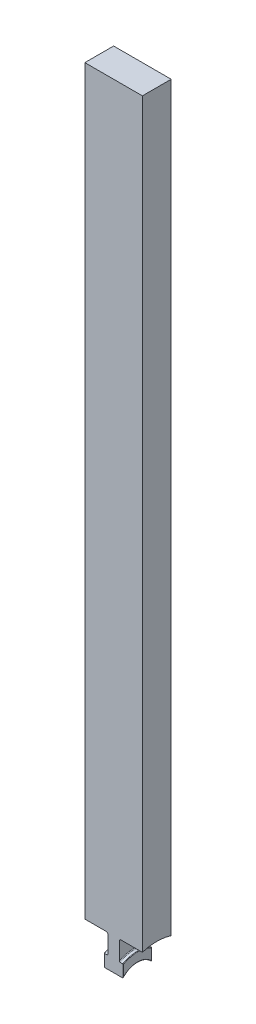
ISO-10303-21;
HEADER;
FILE_DESCRIPTION(('STEP AP214'),'2;1');
FILE_NAME('part.step','',(''),(''),'','','');
FILE_SCHEMA(('AUTOMOTIVE_DESIGN { 1 0 10303 214 1 1 1 1 }'));
ENDSEC;
DATA;
#1=APPLICATION_CONTEXT('core data for automotive mechanical design processes');
#2=APPLICATION_PROTOCOL_DEFINITION('international standard','automotive_design',2000,#1);
#3=PRODUCT_CONTEXT('',#1,'mechanical');
#4=PRODUCT('Part','Part','',(#3));
#5=PRODUCT_RELATED_PRODUCT_CATEGORY('part','',(#4));
#6=PRODUCT_DEFINITION_FORMATION('','',#4);
#7=PRODUCT_DEFINITION_CONTEXT('part definition',#1,'design');
#8=PRODUCT_DEFINITION('design','',#6,#7);
#9=PRODUCT_DEFINITION_SHAPE('','',#8);
#10=(LENGTH_UNIT() NAMED_UNIT(*) SI_UNIT(.MILLI.,.METRE.));
#11=(NAMED_UNIT(*) PLANE_ANGLE_UNIT() SI_UNIT($,.RADIAN.));
#12=(NAMED_UNIT(*) SI_UNIT($,.STERADIAN.) SOLID_ANGLE_UNIT());
#13=UNCERTAINTY_MEASURE_WITH_UNIT(LENGTH_MEASURE(1.E-05),#10,'distance_accuracy_value','');
#14=(GEOMETRIC_REPRESENTATION_CONTEXT(3) GLOBAL_UNCERTAINTY_ASSIGNED_CONTEXT((#13)) GLOBAL_UNIT_ASSIGNED_CONTEXT((#10,
#11,#12)) REPRESENTATION_CONTEXT('',''));
#15=CARTESIAN_POINT('',(0.,0.,0.));
#16=DIRECTION('',(0.,0.,1.));
#17=DIRECTION('',(1.,0.,0.));
#18=AXIS2_PLACEMENT_3D('',#15,#16,#17);
#19=CARTESIAN_POINT('',(15.,410.,7.50000000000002));
#20=DIRECTION('',(0.,0.,-1.));
#21=DIRECTION('',(0.,1.,0.));
#22=AXIS2_PLACEMENT_3D('',#19,#20,#21);
#23=PLANE('',#22);
#24=DIRECTION('',(-1.,0.,0.));
#25=VECTOR('',#24,1.);
#26=CARTESIAN_POINT('',(-8.84822894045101,12.9903810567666,7.49999999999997));
#27=LINE('',#26,#25);
#28=CARTESIAN_POINT('',(-4.75,12.9903810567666,7.49999999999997));
#29=VERTEX_POINT('',#28);
#30=CARTESIAN_POINT('',(-3.381,12.9903810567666,7.49999999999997));
#31=VERTEX_POINT('',#30);
#32=EDGE_CURVE('E731',#29,#31,#27,.F.);
#33=ORIENTED_EDGE('',*,*,#32,.F.);
#34=DIRECTION('',(0.,1.,0.));
#35=VECTOR('',#34,1.);
#36=CARTESIAN_POINT('',(-4.75000000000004,410.,7.50000000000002));
#37=LINE('',#36,#35);
#38=CARTESIAN_POINT('',(-4.75,6.61437827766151,7.49999999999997));
#39=VERTEX_POINT('',#38);
#40=EDGE_CURVE('E442',#29,#39,#37,.F.);
#41=ORIENTED_EDGE('',*,*,#40,.T.);
#42=DIRECTION('',(1.,0.,0.));
#43=VECTOR('',#42,1.);
#44=CARTESIAN_POINT('',(-15.,6.61437827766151,7.49999999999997));
#45=LINE('',#44,#43);
#46=CARTESIAN_POINT('',(4.75,6.61437827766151,7.49999999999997));
#47=VERTEX_POINT('',#46);
#48=EDGE_CURVE('E212',#39,#47,#45,.T.);
#49=ORIENTED_EDGE('',*,*,#48,.T.);
#50=DIRECTION('',(0.,-1.,0.));
#51=VECTOR('',#50,1.);
#52=CARTESIAN_POINT('',(4.74999999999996,410.,7.50000000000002));
#53=LINE('',#52,#51);
#54=CARTESIAN_POINT('',(4.75,12.9903810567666,7.49999999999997));
#55=VERTEX_POINT('',#54);
#56=EDGE_CURVE('E440',#47,#55,#53,.F.);
#57=ORIENTED_EDGE('',*,*,#56,.T.);
#58=DIRECTION('',(-1.,0.,0.));
#59=VECTOR('',#58,1.);
#60=CARTESIAN_POINT('',(-8.84822894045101,12.9903810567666,7.49999999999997));
#61=LINE('',#60,#59);
#62=CARTESIAN_POINT('',(3.381,12.9903810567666,7.49999999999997));
#63=VERTEX_POINT('',#62);
#64=EDGE_CURVE('E734',#63,#55,#61,.F.);
#65=ORIENTED_EDGE('',*,*,#64,.F.);
#66=CARTESIAN_POINT('',(3.381,12.9903810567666,7.49999999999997));
#67=CARTESIAN_POINT('',(3.36159348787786,12.990351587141,7.49999999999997));
#68=CARTESIAN_POINT('',(3.34220939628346,12.9920910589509,7.49999999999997));
#69=CARTESIAN_POINT('',(3.30411089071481,12.9988686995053,7.49999999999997));
#70=CARTESIAN_POINT('',(3.28539391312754,13.0038923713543,7.49999999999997));
#71=CARTESIAN_POINT('',(3.24909102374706,13.0169971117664,7.49999999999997));
#72=CARTESIAN_POINT('',(3.23150411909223,13.0250754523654,7.49999999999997));
#73=CARTESIAN_POINT('',(3.19783116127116,13.0439266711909,7.49999999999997));
#74=CARTESIAN_POINT('',(3.18174642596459,13.054701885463,7.49999999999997));
#75=CARTESIAN_POINT('',(3.15058262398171,13.0791681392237,7.49999999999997));
#76=CARTESIAN_POINT('',(3.1356009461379,13.0929827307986,7.49999999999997));
#77=CARTESIAN_POINT('',(3.10785285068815,13.1226713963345,7.49999999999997));
#78=CARTESIAN_POINT('',(3.09508691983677,13.1385459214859,7.49999999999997));
#79=CARTESIAN_POINT('',(3.07041818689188,13.1740413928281,7.49999999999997));
#80=CARTESIAN_POINT('',(3.05883169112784,13.1938820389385,7.49999999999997));
#81=CARTESIAN_POINT('',(3.03871875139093,13.235070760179,7.49999999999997));
#82=CARTESIAN_POINT('',(3.03019562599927,13.2564204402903,7.49999999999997));
#83=CARTESIAN_POINT('',(3.01549657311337,13.3025258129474,7.49999999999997));
#84=CARTESIAN_POINT('',(3.00968374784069,13.3273972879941,7.49999999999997));
#85=CARTESIAN_POINT('',(3.00193752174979,13.3776913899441,7.49999999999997));
#86=CARTESIAN_POINT('',(2.99999691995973,13.4031129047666,7.49999999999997));
#87=CARTESIAN_POINT('',(3.,13.428520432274,7.49999999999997));
#88=B_SPLINE_CURVE_WITH_KNOTS('',3,(#66,#67,#68,#69,#70,#71,#72,#73,#74,#75,#76,#77,#78,#79,#80,
#81,#82,#83,#84,#85,#86,#87),.UNSPECIFIED.,.F.,.F.,(4,2,2,2,2,2,2,2,2,2,4),(0.,
0.0581065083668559,0.115958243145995,0.173758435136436,0.231608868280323,0.292501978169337,
0.353408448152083,0.422061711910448,0.490789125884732,0.567105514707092,0.643279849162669),.UNSPECIFIED.);
#89=CARTESIAN_POINT('',(3.,13.428520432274,7.49999999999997));
#90=VERTEX_POINT('',#89);
#91=EDGE_CURVE('E312',#63,#90,#88,.T.);
#92=ORIENTED_EDGE('',*,*,#91,.T.);
#93=DIRECTION('',(0.,-1.,0.));
#94=VECTOR('',#93,1.);
#95=CARTESIAN_POINT('',(3.,410.,7.50000000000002));
#96=LINE('',#95,#94);
#97=CARTESIAN_POINT('',(3.,22.5220479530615,7.49999999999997));
#98=VERTEX_POINT('',#97);
#99=EDGE_CURVE('E464',#98,#90,#96,.T.);
#100=ORIENTED_EDGE('',*,*,#99,.F.);
#101=CARTESIAN_POINT('',(3.,22.5220479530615,7.49999999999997));
#102=CARTESIAN_POINT('',(2.99997149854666,22.5689651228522,7.49999999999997));
#103=CARTESIAN_POINT('',(3.00389939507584,22.6158879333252,7.49999999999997));
#104=CARTESIAN_POINT('',(3.01949238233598,22.7084725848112,7.49999999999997));
#105=CARTESIAN_POINT('',(3.03116447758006,22.754133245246,7.49999999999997));
#106=CARTESIAN_POINT('',(3.06208646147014,22.8428798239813,7.49999999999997));
#107=CARTESIAN_POINT('',(3.08134457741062,22.885962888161,7.49999999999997));
#108=CARTESIAN_POINT('',(3.12700930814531,22.9681343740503,7.49999999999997));
#109=CARTESIAN_POINT('',(3.15341113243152,23.0072254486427,7.49999999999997));
#110=CARTESIAN_POINT('',(3.21190757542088,23.0791064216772,7.49999999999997));
#111=CARTESIAN_POINT('',(3.24382440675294,23.1120407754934,7.49999999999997));
#112=CARTESIAN_POINT('',(3.31300016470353,23.171752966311,7.49999999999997));
#113=CARTESIAN_POINT('',(3.35025938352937,23.1985304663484,7.49999999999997));
#114=CARTESIAN_POINT('',(3.42707441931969,23.2437458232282,7.49999999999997));
#115=CARTESIAN_POINT('',(3.46642748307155,23.262528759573,7.49999999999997));
#116=CARTESIAN_POINT('',(3.54780361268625,23.2928652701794,7.49999999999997));
#117=CARTESIAN_POINT('',(3.58982304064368,23.3044284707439,7.49999999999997));
#118=CARTESIAN_POINT('',(3.65386676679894,23.3160362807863,7.49999999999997));
#119=CARTESIAN_POINT('',(3.67540624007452,23.3189494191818,7.49999999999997));
#120=CARTESIAN_POINT('',(3.71862671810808,23.322833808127,7.49999999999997));
#121=CARTESIAN_POINT('',(3.74030745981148,23.323807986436,7.49999999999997));
#122=CARTESIAN_POINT('',(3.76199999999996,23.3238075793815,7.49999999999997));
#123=B_SPLINE_CURVE_WITH_KNOTS('',3,(#101,#102,#103,#104,#105,#106,#107,#108,#109,#110,#111,
#112,#113,#114,#115,#116,#117,#118,#119,#120,#121,#122),.UNSPECIFIED.,.F.,.F.,(4,2,2,2,2,2,2,2,
2,2,4),(0.,0.140598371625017,0.281324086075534,0.422202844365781,0.562987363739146,
0.699875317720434,0.836770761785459,0.966940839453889,1.09693698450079,1.16206792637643,
1.22710044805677),.UNSPECIFIED.);
#124=CARTESIAN_POINT('',(3.762,23.3238075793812,7.49999999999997));
#125=VERTEX_POINT('',#124);
#126=EDGE_CURVE('E277',#98,#125,#123,.T.);
#127=ORIENTED_EDGE('',*,*,#126,.T.);
#128=DIRECTION('',(-1.,0.,0.));
#129=VECTOR('',#128,1.);
#130=CARTESIAN_POINT('',(-8.84822894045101,23.3238075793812,7.49999999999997));
#131=LINE('',#130,#129);
#132=CARTESIAN_POINT('',(15.,23.3238075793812,7.49999999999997));
#133=VERTEX_POINT('',#132);
#134=EDGE_CURVE('E741',#133,#125,#131,.T.);
#135=ORIENTED_EDGE('',*,*,#134,.F.);
#136=DIRECTION('',(0.,-1.,0.));
#137=VECTOR('',#136,1.);
#138=CARTESIAN_POINT('',(15.,410.,7.50000000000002));
#139=LINE('',#138,#137);
#140=CARTESIAN_POINT('',(15.,410.,7.50000000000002));
#141=VERTEX_POINT('',#140);
#142=EDGE_CURVE('E470',#141,#133,#139,.T.);
#143=ORIENTED_EDGE('',*,*,#142,.F.);
#144=DIRECTION('',(-1.,0.,0.));
#145=VECTOR('',#144,1.);
#146=CARTESIAN_POINT('',(15.,410.,7.50000000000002));
#147=LINE('',#146,#145);
#148=CARTESIAN_POINT('',(-15.,410.,7.50000000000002));
#149=VERTEX_POINT('',#148);
#150=EDGE_CURVE('E206',#141,#149,#147,.T.);
#151=ORIENTED_EDGE('',*,*,#150,.T.);
#152=DIRECTION('',(0.,-1.,0.));
#153=VECTOR('',#152,1.);
#154=CARTESIAN_POINT('',(-15.,410.,7.50000000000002));
#155=LINE('',#154,#153);
#156=CARTESIAN_POINT('',(-15.,23.3238075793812,7.49999999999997));
#157=VERTEX_POINT('',#156);
#158=EDGE_CURVE('E198',#149,#157,#155,.T.);
#159=ORIENTED_EDGE('',*,*,#158,.T.);
#160=DIRECTION('',(-1.,0.,0.));
#161=VECTOR('',#160,1.);
#162=CARTESIAN_POINT('',(-8.84822894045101,23.3238075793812,7.49999999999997));
#163=LINE('',#162,#161);
#164=CARTESIAN_POINT('',(-3.762,23.3238075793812,7.49999999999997));
#165=VERTEX_POINT('',#164);
#166=EDGE_CURVE('E179',#165,#157,#163,.T.);
#167=ORIENTED_EDGE('',*,*,#166,.F.);
#168=CARTESIAN_POINT('',(-3.762,23.3238075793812,7.49999999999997));
#169=CARTESIAN_POINT('',(-3.72062832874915,23.3238520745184,7.49999999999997));
#170=CARTESIAN_POINT('',(-3.67927922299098,23.3202713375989,7.49999999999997));
#171=CARTESIAN_POINT('',(-3.59785901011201,23.3062018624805,7.49999999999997));
#172=CARTESIAN_POINT('',(-3.55778541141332,23.2957275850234,7.49999999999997));
#173=CARTESIAN_POINT('',(-3.47996559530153,23.2682105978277,7.49999999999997));
#174=CARTESIAN_POINT('',(-3.44221943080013,23.2511677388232,7.49999999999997));
#175=CARTESIAN_POINT('',(-3.37004313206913,23.2111093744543,7.49999999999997));
#176=CARTESIAN_POINT('',(-3.33561363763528,23.1880927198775,7.49999999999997));
#177=CARTESIAN_POINT('',(-3.27027005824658,23.1363093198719,7.49999999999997));
#178=CARTESIAN_POINT('',(-3.23943952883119,23.107437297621,7.49999999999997));
#179=CARTESIAN_POINT('',(-3.18280382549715,23.0451270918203,7.49999999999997));
#180=CARTESIAN_POINT('',(-3.15699985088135,23.0116878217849,7.49999999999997));
#181=CARTESIAN_POINT('',(-3.10989501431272,22.9395756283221,7.49999999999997));
#182=CARTESIAN_POINT('',(-3.08885347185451,22.9007334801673,7.49999999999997));
#183=CARTESIAN_POINT('',(-3.05325919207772,22.8201786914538,7.49999999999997));
#184=CARTESIAN_POINT('',(-3.03870727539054,22.7784656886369,7.49999999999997));
#185=CARTESIAN_POINT('',(-3.01837577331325,22.7009990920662,7.49999999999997));
#186=CARTESIAN_POINT('',(-3.01148586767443,22.6655314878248,7.49999999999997));
#187=CARTESIAN_POINT('',(-3.00229780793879,22.5940601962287,7.49999999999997));
#188=CARTESIAN_POINT('',(-2.99999277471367,22.5580573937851,7.49999999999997));
#189=CARTESIAN_POINT('',(-3.,22.5220479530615,7.49999999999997));
#190=B_SPLINE_CURVE_WITH_KNOTS('',3,(#168,#169,#170,#171,#172,#173,#174,#175,#176,#177,#178,
#179,#180,#181,#182,#183,#184,#185,#186,#187,#188,#189),.UNSPECIFIED.,.F.,.F.,(4,2,2,2,2,2,2,2,
2,2,4),(0.,0.12392580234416,0.247592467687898,0.371261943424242,0.49495522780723,
0.621109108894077,0.747293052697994,0.879236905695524,1.01119743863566,1.11930081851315,
1.2272418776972),.UNSPECIFIED.);
#191=CARTESIAN_POINT('',(-3.,22.5220479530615,7.49999999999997));
#192=VERTEX_POINT('',#191);
#193=EDGE_CURVE('E243',#165,#192,#190,.T.);
#194=ORIENTED_EDGE('',*,*,#193,.T.);
#195=DIRECTION('',(0.,1.,0.));
#196=VECTOR('',#195,1.);
#197=CARTESIAN_POINT('',(-3.,410.,7.50000000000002));
#198=LINE('',#197,#196);
#199=CARTESIAN_POINT('',(-3.,13.428520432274,7.49999999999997));
#200=VERTEX_POINT('',#199);
#201=EDGE_CURVE('E732',#200,#192,#198,.T.);
#202=ORIENTED_EDGE('',*,*,#201,.F.);
#203=CARTESIAN_POINT('',(-3.,13.428520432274,7.49999999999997));
#204=CARTESIAN_POINT('',(-2.99998773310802,13.3960473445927,7.49999999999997));
#205=CARTESIAN_POINT('',(-3.00316588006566,13.3635248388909,7.49999999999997));
#206=CARTESIAN_POINT('',(-3.01585357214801,13.2995632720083,7.49999999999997));
#207=CARTESIAN_POINT('',(-3.02539701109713,13.2681309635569,7.49999999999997));
#208=CARTESIAN_POINT('',(-3.04884901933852,13.2124568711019,7.49999999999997));
#209=CARTESIAN_POINT('',(-3.06188078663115,13.1878460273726,7.49999999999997));
#210=CARTESIAN_POINT('',(-3.09231245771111,13.1415402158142,7.49999999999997));
#211=CARTESIAN_POINT('',(-3.10970093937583,13.1198378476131,7.49999999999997));
#212=CARTESIAN_POINT('',(-3.14655915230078,13.0824144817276,7.49999999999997));
#213=CARTESIAN_POINT('',(-3.16563766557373,13.0663097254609,7.49999999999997));
#214=CARTESIAN_POINT('',(-3.20659393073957,13.0381967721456,7.49999999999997));
#215=CARTESIAN_POINT('',(-3.22846666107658,13.0261813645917,7.49999999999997));
#216=CARTESIAN_POINT('',(-3.2717749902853,13.0081040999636,7.49999999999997));
#217=CARTESIAN_POINT('',(-3.2929987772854,13.0015363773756,7.49999999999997));
#218=CARTESIAN_POINT('',(-3.33646159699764,12.9926369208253,7.49999999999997));
#219=CARTESIAN_POINT('',(-3.35870658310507,12.9903344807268,7.49999999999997));
#220=CARTESIAN_POINT('',(-3.381,12.9903810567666,7.49999999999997));
#221=B_SPLINE_CURVE_WITH_KNOTS('',3,(#203,#204,#205,#206,#207,#208,#209,#210,#211,#212,#213,
#214,#215,#216,#217,#218,#219,#220),.UNSPECIFIED.,.F.,.F.,(4,2,2,2,2,2,2,2,4),(0.,
0.0973546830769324,0.195231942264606,0.278328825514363,0.36121009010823,0.435666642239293,
0.509991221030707,0.576221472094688,0.642904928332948),.UNSPECIFIED.);
#222=EDGE_CURVE('E292',#200,#31,#221,.T.);
#223=ORIENTED_EDGE('',*,*,#222,.T.);
#224=EDGE_LOOP('',(#33,#41,#49,#57,#65,#92,#100,#127,#135,#143,#151,#159,#167,#194,#202,#223));
#225=FACE_BOUND('',#224,.T.);
#226=ADVANCED_FACE('F37',(#225),#23,.F.);
#227=CARTESIAN_POINT('',(15.,410.,-7.49999999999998));
#228=DIRECTION('',(0.,0.,1.));
#229=DIRECTION('',(0.,-1.,0.));
#230=AXIS2_PLACEMENT_3D('',#227,#228,#229);
#231=PLANE('',#230);
#232=DIRECTION('',(1.,0.,0.));
#233=VECTOR('',#232,1.);
#234=CARTESIAN_POINT('',(-15.,6.61437827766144,-7.50000000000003));
#235=LINE('',#234,#233);
#236=CARTESIAN_POINT('',(4.75,6.61437827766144,-7.50000000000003));
#237=VERTEX_POINT('',#236);
#238=CARTESIAN_POINT('',(-4.75,6.61437827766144,-7.50000000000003));
#239=VERTEX_POINT('',#238);
#240=EDGE_CURVE('E462',#237,#239,#235,.F.);
#241=ORIENTED_EDGE('',*,*,#240,.T.);
#242=DIRECTION('',(0.,1.,0.));
#243=VECTOR('',#242,1.);
#244=CARTESIAN_POINT('',(-4.75000000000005,410.,-7.49999999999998));
#245=LINE('',#244,#243);
#246=CARTESIAN_POINT('',(-4.75,12.9903810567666,-7.50000000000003));
#247=VERTEX_POINT('',#246);
#248=EDGE_CURVE('E432',#239,#247,#245,.T.);
#249=ORIENTED_EDGE('',*,*,#248,.T.);
#250=DIRECTION('',(-1.,0.,0.));
#251=VECTOR('',#250,1.);
#252=CARTESIAN_POINT('',(-8.84822894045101,12.9903810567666,-7.50000000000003));
#253=LINE('',#252,#251);
#254=CARTESIAN_POINT('',(-3.381,12.9903810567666,-7.50000000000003));
#255=VERTEX_POINT('',#254);
#256=EDGE_CURVE('E747',#255,#247,#253,.T.);
#257=ORIENTED_EDGE('',*,*,#256,.F.);
#258=CARTESIAN_POINT('',(-3.381,12.9903810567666,-7.50000000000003));
#259=CARTESIAN_POINT('',(-3.36159348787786,12.9903515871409,-7.50000000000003));
#260=CARTESIAN_POINT('',(-3.34220939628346,12.9920910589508,-7.50000000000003));
#261=CARTESIAN_POINT('',(-3.30411089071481,12.9988686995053,-7.50000000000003));
#262=CARTESIAN_POINT('',(-3.28539391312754,13.0038923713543,-7.50000000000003));
#263=CARTESIAN_POINT('',(-3.24909102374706,13.0169971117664,-7.50000000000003));
#264=CARTESIAN_POINT('',(-3.23150411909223,13.0250754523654,-7.50000000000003));
#265=CARTESIAN_POINT('',(-3.19783116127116,13.0439266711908,-7.50000000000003));
#266=CARTESIAN_POINT('',(-3.18174642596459,13.054701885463,-7.50000000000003));
#267=CARTESIAN_POINT('',(-3.1505826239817,13.0791681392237,-7.50000000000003));
#268=CARTESIAN_POINT('',(-3.13560094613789,13.0929827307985,-7.50000000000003));
#269=CARTESIAN_POINT('',(-3.10785285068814,13.1226713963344,-7.50000000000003));
#270=CARTESIAN_POINT('',(-3.09508691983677,13.1385459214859,-7.50000000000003));
#271=CARTESIAN_POINT('',(-3.07041818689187,13.174041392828,-7.50000000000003));
#272=CARTESIAN_POINT('',(-3.05883169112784,13.1938820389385,-7.50000000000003));
#273=CARTESIAN_POINT('',(-3.03871875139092,13.2350707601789,-7.50000000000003));
#274=CARTESIAN_POINT('',(-3.03019562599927,13.2564204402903,-7.50000000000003));
#275=CARTESIAN_POINT('',(-3.01549657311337,13.3025258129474,-7.50000000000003));
#276=CARTESIAN_POINT('',(-3.00968374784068,13.327397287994,-7.50000000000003));
#277=CARTESIAN_POINT('',(-3.00193752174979,13.3776913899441,-7.50000000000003));
#278=CARTESIAN_POINT('',(-2.99999691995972,13.4031129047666,-7.50000000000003));
#279=CARTESIAN_POINT('',(-3.,13.428520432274,-7.50000000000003));
#280=B_SPLINE_CURVE_WITH_KNOTS('',3,(#258,#259,#260,#261,#262,#263,#264,#265,#266,#267,#268,
#269,#270,#271,#272,#273,#274,#275,#276,#277,#278,#279),.UNSPECIFIED.,.F.,.F.,(4,2,2,2,2,2,2,2,
2,2,4),(0.,0.058106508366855,0.115958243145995,0.173758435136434,0.231608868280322,
0.292501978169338,0.353408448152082,0.422061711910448,0.490789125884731,0.567105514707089,
0.643279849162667),.UNSPECIFIED.);
#281=CARTESIAN_POINT('',(-3.,13.428520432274,-7.50000000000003));
#282=VERTEX_POINT('',#281);
#283=EDGE_CURVE('E301',#255,#282,#280,.T.);
#284=ORIENTED_EDGE('',*,*,#283,.T.);
#285=DIRECTION('',(0.,-1.,0.));
#286=VECTOR('',#285,1.);
#287=CARTESIAN_POINT('',(-3.,410.,-7.49999999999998));
#288=LINE('',#287,#286);
#289=CARTESIAN_POINT('',(-3.,22.5220479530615,-7.50000000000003));
#290=VERTEX_POINT('',#289);
#291=EDGE_CURVE('E221',#290,#282,#288,.T.);
#292=ORIENTED_EDGE('',*,*,#291,.F.);
#293=CARTESIAN_POINT('',(-3.,22.5220479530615,-7.50000000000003));
#294=CARTESIAN_POINT('',(-2.99997149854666,22.5689651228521,-7.50000000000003));
#295=CARTESIAN_POINT('',(-3.00389939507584,22.6158879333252,-7.50000000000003));
#296=CARTESIAN_POINT('',(-3.01949238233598,22.7084725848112,-7.50000000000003));
#297=CARTESIAN_POINT('',(-3.03116447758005,22.754133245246,-7.50000000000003));
#298=CARTESIAN_POINT('',(-3.06208646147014,22.8428798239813,-7.50000000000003));
#299=CARTESIAN_POINT('',(-3.08134457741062,22.8859628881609,-7.50000000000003));
#300=CARTESIAN_POINT('',(-3.12700930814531,22.9681343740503,-7.50000000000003));
#301=CARTESIAN_POINT('',(-3.15341113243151,23.0072254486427,-7.50000000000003));
#302=CARTESIAN_POINT('',(-3.21190757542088,23.0791064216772,-7.50000000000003));
#303=CARTESIAN_POINT('',(-3.24382440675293,23.1120407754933,-7.50000000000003));
#304=CARTESIAN_POINT('',(-3.31300016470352,23.1717529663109,-7.50000000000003));
#305=CARTESIAN_POINT('',(-3.35025938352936,23.1985304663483,-7.50000000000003));
#306=CARTESIAN_POINT('',(-3.42707441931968,23.2437458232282,-7.50000000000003));
#307=CARTESIAN_POINT('',(-3.46642748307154,23.262528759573,-7.50000000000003));
#308=CARTESIAN_POINT('',(-3.54780361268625,23.2928652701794,-7.50000000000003));
#309=CARTESIAN_POINT('',(-3.58982304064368,23.3044284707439,-7.50000000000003));
#310=CARTESIAN_POINT('',(-3.65386676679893,23.3160362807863,-7.50000000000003));
#311=CARTESIAN_POINT('',(-3.67540624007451,23.3189494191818,-7.50000000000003));
#312=CARTESIAN_POINT('',(-3.71862671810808,23.322833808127,-7.50000000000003));
#313=CARTESIAN_POINT('',(-3.74030745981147,23.323807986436,-7.50000000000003));
#314=CARTESIAN_POINT('',(-3.76199999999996,23.3238075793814,-7.50000000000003));
#315=B_SPLINE_CURVE_WITH_KNOTS('',3,(#293,#294,#295,#296,#297,#298,#299,#300,#301,#302,#303,
#304,#305,#306,#307,#308,#309,#310,#311,#312,#313,#314),.UNSPECIFIED.,.F.,.F.,(4,2,2,2,2,2,2,2,
2,2,4),(0.,0.140598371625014,0.281324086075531,0.422202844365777,0.562987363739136,
0.699875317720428,0.836770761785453,0.966940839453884,1.09693698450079,1.16206792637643,
1.22710044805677),.UNSPECIFIED.);
#316=CARTESIAN_POINT('',(-3.762,23.3238075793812,-7.50000000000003));
#317=VERTEX_POINT('',#316);
#318=EDGE_CURVE('E235',#290,#317,#315,.T.);
#319=ORIENTED_EDGE('',*,*,#318,.T.);
#320=DIRECTION('',(-1.,0.,0.));
#321=VECTOR('',#320,1.);
#322=CARTESIAN_POINT('',(-8.84822894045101,23.3238075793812,-7.50000000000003));
#323=LINE('',#322,#321);
#324=CARTESIAN_POINT('',(-15.,23.3238075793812,-7.50000000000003));
#325=VERTEX_POINT('',#324);
#326=EDGE_CURVE('E192',#325,#317,#323,.F.);
#327=ORIENTED_EDGE('',*,*,#326,.F.);
#328=DIRECTION('',(0.,1.,0.));
#329=VECTOR('',#328,1.);
#330=CARTESIAN_POINT('',(-15.,410.,-7.49999999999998));
#331=LINE('',#330,#329);
#332=CARTESIAN_POINT('',(-15.,410.,-7.49999999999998));
#333=VERTEX_POINT('',#332);
#334=EDGE_CURVE('E200',#325,#333,#331,.T.);
#335=ORIENTED_EDGE('',*,*,#334,.T.);
#336=DIRECTION('',(-1.,0.,0.));
#337=VECTOR('',#336,1.);
#338=CARTESIAN_POINT('',(15.,410.,-7.49999999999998));
#339=LINE('',#338,#337);
#340=CARTESIAN_POINT('',(15.,410.,-7.49999999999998));
#341=VERTEX_POINT('',#340);
#342=EDGE_CURVE('E216',#341,#333,#339,.T.);
#343=ORIENTED_EDGE('',*,*,#342,.F.);
#344=DIRECTION('',(0.,1.,0.));
#345=VECTOR('',#344,1.);
#346=CARTESIAN_POINT('',(15.,410.,-7.49999999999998));
#347=LINE('',#346,#345);
#348=CARTESIAN_POINT('',(15.,23.3238075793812,-7.50000000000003));
#349=VERTEX_POINT('',#348);
#350=EDGE_CURVE('E219',#349,#341,#347,.T.);
#351=ORIENTED_EDGE('',*,*,#350,.F.);
#352=DIRECTION('',(-1.,0.,0.));
#353=VECTOR('',#352,1.);
#354=CARTESIAN_POINT('',(-8.84822894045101,23.3238075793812,-7.50000000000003));
#355=LINE('',#354,#353);
#356=CARTESIAN_POINT('',(3.762,23.3238075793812,-7.50000000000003));
#357=VERTEX_POINT('',#356);
#358=EDGE_CURVE('E191',#357,#349,#355,.F.);
#359=ORIENTED_EDGE('',*,*,#358,.F.);
#360=CARTESIAN_POINT('',(3.762,23.3238075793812,-7.50000000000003));
#361=CARTESIAN_POINT('',(3.72062832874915,23.3238520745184,-7.50000000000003));
#362=CARTESIAN_POINT('',(3.67927922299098,23.3202713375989,-7.50000000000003));
#363=CARTESIAN_POINT('',(3.59785901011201,23.3062018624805,-7.50000000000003));
#364=CARTESIAN_POINT('',(3.55778541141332,23.2957275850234,-7.50000000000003));
#365=CARTESIAN_POINT('',(3.47996559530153,23.2682105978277,-7.50000000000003));
#366=CARTESIAN_POINT('',(3.44221943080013,23.2511677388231,-7.50000000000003));
#367=CARTESIAN_POINT('',(3.37004313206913,23.2111093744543,-7.50000000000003));
#368=CARTESIAN_POINT('',(3.33561363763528,23.1880927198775,-7.50000000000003));
#369=CARTESIAN_POINT('',(3.27027005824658,23.1363093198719,-7.50000000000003));
#370=CARTESIAN_POINT('',(3.2394395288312,23.107437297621,-7.50000000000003));
#371=CARTESIAN_POINT('',(3.18280382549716,23.0451270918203,-7.50000000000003));
#372=CARTESIAN_POINT('',(3.15699985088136,23.0116878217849,-7.50000000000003));
#373=CARTESIAN_POINT('',(3.10989501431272,22.9395756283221,-7.50000000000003));
#374=CARTESIAN_POINT('',(3.08885347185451,22.9007334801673,-7.50000000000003));
#375=CARTESIAN_POINT('',(3.05325919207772,22.8201786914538,-7.50000000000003));
#376=CARTESIAN_POINT('',(3.03870727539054,22.7784656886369,-7.50000000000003));
#377=CARTESIAN_POINT('',(3.01837577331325,22.7009990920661,-7.50000000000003));
#378=CARTESIAN_POINT('',(3.01148586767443,22.6655314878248,-7.50000000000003));
#379=CARTESIAN_POINT('',(3.00229780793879,22.5940601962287,-7.50000000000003));
#380=CARTESIAN_POINT('',(2.99999277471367,22.5580573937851,-7.50000000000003));
#381=CARTESIAN_POINT('',(3.,22.5220479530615,-7.50000000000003));
#382=B_SPLINE_CURVE_WITH_KNOTS('',3,(#360,#361,#362,#363,#364,#365,#366,#367,#368,#369,#370,
#371,#372,#373,#374,#375,#376,#377,#378,#379,#380,#381),.UNSPECIFIED.,.F.,.F.,(4,2,2,2,2,2,2,2,
2,2,4),(0.,0.123925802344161,0.247592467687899,0.371261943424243,0.494955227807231,
0.621109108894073,0.747293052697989,0.879236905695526,1.01119743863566,1.11930081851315,
1.2272418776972),.UNSPECIFIED.);
#383=CARTESIAN_POINT('',(3.,22.5220479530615,-7.50000000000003));
#384=VERTEX_POINT('',#383);
#385=EDGE_CURVE('E271',#357,#384,#382,.T.);
#386=ORIENTED_EDGE('',*,*,#385,.T.);
#387=DIRECTION('',(0.,1.,0.));
#388=VECTOR('',#387,1.);
#389=CARTESIAN_POINT('',(3.,410.,-7.49999999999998));
#390=LINE('',#389,#388);
#391=CARTESIAN_POINT('',(3.,13.428520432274,-7.50000000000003));
#392=VERTEX_POINT('',#391);
#393=EDGE_CURVE('E224',#392,#384,#390,.T.);
#394=ORIENTED_EDGE('',*,*,#393,.F.);
#395=CARTESIAN_POINT('',(3.,13.428520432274,-7.50000000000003));
#396=CARTESIAN_POINT('',(2.99998773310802,13.3960473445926,-7.50000000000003));
#397=CARTESIAN_POINT('',(3.00316588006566,13.3635248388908,-7.50000000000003));
#398=CARTESIAN_POINT('',(3.01585357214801,13.2995632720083,-7.50000000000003));
#399=CARTESIAN_POINT('',(3.02539701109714,13.2681309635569,-7.50000000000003));
#400=CARTESIAN_POINT('',(3.04884901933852,13.2124568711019,-7.50000000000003));
#401=CARTESIAN_POINT('',(3.06188078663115,13.1878460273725,-7.50000000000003));
#402=CARTESIAN_POINT('',(3.09231245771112,13.1415402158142,-7.50000000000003));
#403=CARTESIAN_POINT('',(3.10970093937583,13.1198378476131,-7.50000000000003));
#404=CARTESIAN_POINT('',(3.14655915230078,13.0824144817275,-7.50000000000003));
#405=CARTESIAN_POINT('',(3.16563766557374,13.0663097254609,-7.50000000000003));
#406=CARTESIAN_POINT('',(3.20659393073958,13.0381967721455,-7.50000000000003));
#407=CARTESIAN_POINT('',(3.22846666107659,13.0261813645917,-7.50000000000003));
#408=CARTESIAN_POINT('',(3.27177499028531,13.0081040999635,-7.50000000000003));
#409=CARTESIAN_POINT('',(3.2929987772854,13.0015363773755,-7.50000000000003));
#410=CARTESIAN_POINT('',(3.33646159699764,12.9926369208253,-7.50000000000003));
#411=CARTESIAN_POINT('',(3.35870658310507,12.9903344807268,-7.50000000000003));
#412=CARTESIAN_POINT('',(3.381,12.9903810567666,-7.50000000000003));
#413=B_SPLINE_CURVE_WITH_KNOTS('',3,(#395,#396,#397,#398,#399,#400,#401,#402,#403,#404,#405,
#406,#407,#408,#409,#410,#411,#412),.UNSPECIFIED.,.F.,.F.,(4,2,2,2,2,2,2,2,4),(0.,
0.0973546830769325,0.195231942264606,0.278328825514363,0.361210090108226,0.435666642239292,
0.509991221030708,0.576221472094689,0.642904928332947),.UNSPECIFIED.);
#414=CARTESIAN_POINT('',(3.381,12.9903810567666,-7.50000000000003));
#415=VERTEX_POINT('',#414);
#416=EDGE_CURVE('E300',#392,#415,#413,.T.);
#417=ORIENTED_EDGE('',*,*,#416,.T.);
#418=DIRECTION('',(-1.,0.,0.));
#419=VECTOR('',#418,1.);
#420=CARTESIAN_POINT('',(-8.84822894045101,12.9903810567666,-7.50000000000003));
#421=LINE('',#420,#419);
#422=CARTESIAN_POINT('',(4.75,12.9903810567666,-7.50000000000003));
#423=VERTEX_POINT('',#422);
#424=EDGE_CURVE('E737',#423,#415,#421,.T.);
#425=ORIENTED_EDGE('',*,*,#424,.F.);
#426=DIRECTION('',(0.,-1.,0.));
#427=VECTOR('',#426,1.);
#428=CARTESIAN_POINT('',(4.74999999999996,410.,-7.49999999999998));
#429=LINE('',#428,#427);
#430=EDGE_CURVE('E407',#423,#237,#429,.T.);
#431=ORIENTED_EDGE('',*,*,#430,.T.);
#432=EDGE_LOOP('',(#241,#249,#257,#284,#292,#319,#327,#335,#343,#351,#359,#386,#394,#417,#425,#431));
#433=FACE_BOUND('',#432,.T.);
#434=ADVANCED_FACE('F250',(#433),#231,.F.);
#435=CARTESIAN_POINT('',(-15.,0.,0.));
#436=DIRECTION('',(-1.,0.,0.));
#437=DIRECTION('',(0.,0.,1.));
#438=AXIS2_PLACEMENT_3D('',#435,#436,#437);
#439=PLANE('',#438);
#440=ORIENTED_EDGE('',*,*,#334,.F.);
#441=CARTESIAN_POINT('',(-15.,0.,0.));
#442=DIRECTION('',(-1.,0.,0.));
#443=DIRECTION('',(0.,0.,1.));
#444=AXIS2_PLACEMENT_3D('',#441,#442,#443);
#445=CIRCLE('',#444,24.5);
#446=EDGE_CURVE('E183',#157,#325,#445,.T.);
#447=ORIENTED_EDGE('',*,*,#446,.F.);
#448=ORIENTED_EDGE('',*,*,#158,.F.);
#449=DIRECTION('',(0.,0.,1.));
#450=VECTOR('',#449,1.);
#451=CARTESIAN_POINT('',(-15.,410.,7.50000000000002));
#452=LINE('',#451,#450);
#453=EDGE_CURVE('E208',#333,#149,#452,.T.);
#454=ORIENTED_EDGE('',*,*,#453,.F.);
#455=EDGE_LOOP('',(#440,#447,#448,#454));
#456=FACE_BOUND('',#455,.T.);
#457=ADVANCED_FACE('F196',(#456),#439,.T.);
#458=CARTESIAN_POINT('',(15.,410.,7.50000000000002));
#459=DIRECTION('',(0.,-1.,0.));
#460=DIRECTION('',(0.,0.,-1.));
#461=AXIS2_PLACEMENT_3D('',#458,#459,#460);
#462=PLANE('',#461);
#463=ORIENTED_EDGE('',*,*,#453,.T.);
#464=ORIENTED_EDGE('',*,*,#150,.F.);
#465=DIRECTION('',(0.,0.,1.));
#466=VECTOR('',#465,1.);
#467=CARTESIAN_POINT('',(15.,410.,7.50000000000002));
#468=LINE('',#467,#466);
#469=EDGE_CURVE('E210',#341,#141,#468,.T.);
#470=ORIENTED_EDGE('',*,*,#469,.F.);
#471=ORIENTED_EDGE('',*,*,#342,.T.);
#472=EDGE_LOOP('',(#463,#464,#470,#471));
#473=FACE_BOUND('',#472,.T.);
#474=ADVANCED_FACE('F261',(#473),#462,.F.);
#475=CARTESIAN_POINT('',(15.,0.,0.));
#476=DIRECTION('',(-1.,0.,0.));
#477=DIRECTION('',(0.,0.,1.));
#478=AXIS2_PLACEMENT_3D('',#475,#476,#477);
#479=PLANE('',#478);
#480=CARTESIAN_POINT('',(15.,0.,0.));
#481=DIRECTION('',(-1.,0.,0.));
#482=DIRECTION('',(0.,0.,1.));
#483=AXIS2_PLACEMENT_3D('',#480,#481,#482);
#484=CIRCLE('',#483,24.5);
#485=EDGE_CURVE('E201',#133,#349,#484,.T.);
#486=ORIENTED_EDGE('',*,*,#485,.T.);
#487=ORIENTED_EDGE('',*,*,#350,.T.);
#488=ORIENTED_EDGE('',*,*,#469,.T.);
#489=ORIENTED_EDGE('',*,*,#142,.T.);
#490=EDGE_LOOP('',(#486,#487,#488,#489));
#491=FACE_BOUND('',#490,.T.);
#492=ADVANCED_FACE('F476',(#491),#479,.F.);
#493=CARTESIAN_POINT('',(-15.,0.,0.));
#494=DIRECTION('',(1.,0.,0.));
#495=DIRECTION('',(0.,0.,-1.));
#496=AXIS2_PLACEMENT_3D('',#493,#494,#495);
#497=CYLINDRICAL_SURFACE('',#496,10.);
#498=ORIENTED_EDGE('',*,*,#48,.F.);
#499=CARTESIAN_POINT('',(-4.75,0.,0.));
#500=DIRECTION('',(1.,0.,0.));
#501=DIRECTION('',(0.,1.,0.));
#502=AXIS2_PLACEMENT_3D('',#499,#500,#501);
#503=CIRCLE('',#502,10.);
#504=EDGE_CURVE('E419',#39,#239,#503,.F.);
#505=ORIENTED_EDGE('',*,*,#504,.T.);
#506=ORIENTED_EDGE('',*,*,#240,.F.);
#507=CARTESIAN_POINT('',(4.75,0.,0.));
#508=DIRECTION('',(-1.,0.,0.));
#509=DIRECTION('',(0.,-1.,0.));
#510=AXIS2_PLACEMENT_3D('',#507,#508,#509);
#511=CIRCLE('',#510,10.);
#512=EDGE_CURVE('E459',#237,#47,#511,.F.);
#513=ORIENTED_EDGE('',*,*,#512,.T.);
#514=EDGE_LOOP('',(#498,#505,#506,#513));
#515=FACE_BOUND('',#514,.T.);
#516=ADVANCED_FACE('F460',(#515),#497,.F.);
#517=CARTESIAN_POINT('',(-3.,15.,0.));
#518=DIRECTION('',(-1.,0.,0.));
#519=DIRECTION('',(0.,0.,1.));
#520=AXIS2_PLACEMENT_3D('',#517,#518,#519);
#521=PLANE('',#520);
#522=ORIENTED_EDGE('',*,*,#291,.T.);
#523=CARTESIAN_POINT('',(-3.,0.,0.));
#524=DIRECTION('',(-1.,0.,0.));
#525=DIRECTION('',(0.,0.,1.));
#526=AXIS2_PLACEMENT_3D('',#523,#524,#525);
#527=CIRCLE('',#526,15.381);
#528=EDGE_CURVE('E728',#282,#200,#527,.F.);
#529=ORIENTED_EDGE('',*,*,#528,.T.);
#530=ORIENTED_EDGE('',*,*,#201,.T.);
#531=CARTESIAN_POINT('',(-3.,0.,0.));
#532=DIRECTION('',(-1.,0.,0.));
#533=DIRECTION('',(0.,0.,1.));
#534=AXIS2_PLACEMENT_3D('',#531,#532,#533);
#535=CIRCLE('',#534,23.738);
#536=EDGE_CURVE('E226',#192,#290,#535,.T.);
#537=ORIENTED_EDGE('',*,*,#536,.T.);
#538=EDGE_LOOP('',(#522,#529,#530,#537));
#539=FACE_BOUND('',#538,.T.);
#540=ADVANCED_FACE('F493',(#539),#521,.T.);
#541=CARTESIAN_POINT('',(-8.84822894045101,0.,0.));
#542=DIRECTION('',(-1.,0.,0.));
#543=DIRECTION('',(0.,0.,1.));
#544=AXIS2_PLACEMENT_3D('',#541,#542,#543);
#545=CYLINDRICAL_SURFACE('',#544,24.5);
#546=ORIENTED_EDGE('',*,*,#326,.T.);
#547=CARTESIAN_POINT('',(-3.762,0.,0.));
#548=DIRECTION('',(-1.,0.,0.));
#549=DIRECTION('',(0.,0.,1.));
#550=AXIS2_PLACEMENT_3D('',#547,#548,#549);
#551=CIRCLE('',#550,24.5);
#552=EDGE_CURVE('E186',#317,#165,#551,.F.);
#553=ORIENTED_EDGE('',*,*,#552,.T.);
#554=ORIENTED_EDGE('',*,*,#166,.T.);
#555=ORIENTED_EDGE('',*,*,#446,.T.);
#556=EDGE_LOOP('',(#546,#553,#554,#555));
#557=FACE_BOUND('',#556,.T.);
#558=ADVANCED_FACE('F182',(#557),#545,.F.);
#559=CARTESIAN_POINT('',(-8.84822894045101,0.,0.));
#560=DIRECTION('',(-1.,0.,0.));
#561=DIRECTION('',(0.,0.,1.));
#562=AXIS2_PLACEMENT_3D('',#559,#560,#561);
#563=CYLINDRICAL_SURFACE('',#562,15.);
#564=ORIENTED_EDGE('',*,*,#256,.T.);
#565=CARTESIAN_POINT('',(-4.75,0.,0.));
#566=DIRECTION('',(1.,0.,0.));
#567=DIRECTION('',(0.,1.,0.));
#568=AXIS2_PLACEMENT_3D('',#565,#566,#567);
#569=CIRCLE('',#568,15.);
#570=EDGE_CURVE('E438',#247,#29,#569,.T.);
#571=ORIENTED_EDGE('',*,*,#570,.T.);
#572=ORIENTED_EDGE('',*,*,#32,.T.);
#573=CARTESIAN_POINT('',(-3.381,0.,0.));
#574=DIRECTION('',(-1.,0.,0.));
#575=DIRECTION('',(0.,0.,1.));
#576=AXIS2_PLACEMENT_3D('',#573,#574,#575);
#577=CIRCLE('',#576,15.);
#578=EDGE_CURVE('E283',#31,#255,#577,.T.);
#579=ORIENTED_EDGE('',*,*,#578,.T.);
#580=EDGE_LOOP('',(#564,#571,#572,#579));
#581=FACE_BOUND('',#580,.T.);
#582=ADVANCED_FACE('F496',(#581),#563,.T.);
#583=CARTESIAN_POINT('',(3.,15.,0.));
#584=DIRECTION('',(1.,0.,0.));
#585=DIRECTION('',(0.,0.,-1.));
#586=AXIS2_PLACEMENT_3D('',#583,#584,#585);
#587=PLANE('',#586);
#588=ORIENTED_EDGE('',*,*,#99,.T.);
#589=CARTESIAN_POINT('',(3.,0.,0.));
#590=DIRECTION('',(1.,0.,0.));
#591=DIRECTION('',(0.,0.,-1.));
#592=AXIS2_PLACEMENT_3D('',#589,#590,#591);
#593=CIRCLE('',#592,15.381);
#594=EDGE_CURVE('E762',#90,#392,#593,.F.);
#595=ORIENTED_EDGE('',*,*,#594,.T.);
#596=ORIENTED_EDGE('',*,*,#393,.T.);
#597=CARTESIAN_POINT('',(3.,0.,0.));
#598=DIRECTION('',(1.,0.,0.));
#599=DIRECTION('',(0.,0.,-1.));
#600=AXIS2_PLACEMENT_3D('',#597,#598,#599);
#601=CIRCLE('',#600,23.738);
#602=EDGE_CURVE('E233',#384,#98,#601,.T.);
#603=ORIENTED_EDGE('',*,*,#602,.T.);
#604=EDGE_LOOP('',(#588,#595,#596,#603));
#605=FACE_BOUND('',#604,.T.);
#606=ADVANCED_FACE('F499',(#605),#587,.T.);
#607=CARTESIAN_POINT('',(-8.84822894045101,0.,0.));
#608=DIRECTION('',(-1.,0.,0.));
#609=DIRECTION('',(0.,0.,1.));
#610=AXIS2_PLACEMENT_3D('',#607,#608,#609);
#611=CYLINDRICAL_SURFACE('',#610,15.);
#612=ORIENTED_EDGE('',*,*,#64,.T.);
#613=CARTESIAN_POINT('',(4.75,0.,0.));
#614=DIRECTION('',(-1.,0.,0.));
#615=DIRECTION('',(0.,-1.,0.));
#616=AXIS2_PLACEMENT_3D('',#613,#614,#615);
#617=CIRCLE('',#616,15.);
#618=EDGE_CURVE('E11',#55,#423,#617,.T.);
#619=ORIENTED_EDGE('',*,*,#618,.T.);
#620=ORIENTED_EDGE('',*,*,#424,.T.);
#621=CARTESIAN_POINT('',(3.381,0.,0.));
#622=DIRECTION('',(1.,0.,0.));
#623=DIRECTION('',(0.,0.,-1.));
#624=AXIS2_PLACEMENT_3D('',#621,#622,#623);
#625=CIRCLE('',#624,15.);
#626=EDGE_CURVE('E757',#415,#63,#625,.T.);
#627=ORIENTED_EDGE('',*,*,#626,.T.);
#628=EDGE_LOOP('',(#612,#619,#620,#627));
#629=FACE_BOUND('',#628,.T.);
#630=ADVANCED_FACE('F504',(#629),#611,.T.);
#631=CARTESIAN_POINT('',(-8.84822894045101,0.,0.));
#632=DIRECTION('',(-1.,0.,0.));
#633=DIRECTION('',(0.,0.,1.));
#634=AXIS2_PLACEMENT_3D('',#631,#632,#633);
#635=CYLINDRICAL_SURFACE('',#634,24.5);
#636=ORIENTED_EDGE('',*,*,#134,.T.);
#637=CARTESIAN_POINT('',(3.762,0.,0.));
#638=DIRECTION('',(1.,0.,0.));
#639=DIRECTION('',(0.,0.,-1.));
#640=AXIS2_PLACEMENT_3D('',#637,#638,#639);
#641=CIRCLE('',#640,24.5);
#642=EDGE_CURVE('E230',#125,#357,#641,.F.);
#643=ORIENTED_EDGE('',*,*,#642,.T.);
#644=ORIENTED_EDGE('',*,*,#358,.T.);
#645=ORIENTED_EDGE('',*,*,#485,.F.);
#646=EDGE_LOOP('',(#636,#643,#644,#645));
#647=FACE_BOUND('',#646,.T.);
#648=ADVANCED_FACE('F507',(#647),#635,.F.);
#649=CARTESIAN_POINT('',(5.,15.,-7.50000000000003));
#650=DIRECTION('',(-1.,0.,0.));
#651=DIRECTION('',(0.,-1.,0.));
#652=AXIS2_PLACEMENT_3D('',#649,#650,#651);
#653=PLANE('',#652);
#654=DIRECTION('',(0.,-1.,0.));
#655=VECTOR('',#654,1.);
#656=CARTESIAN_POINT('',(5.,15.,7.24999999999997));
#657=LINE('',#656,#655);
#658=CARTESIAN_POINT('',(5.,12.8452325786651,7.24999999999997));
#659=VERTEX_POINT('',#658);
#660=CARTESIAN_POINT('',(5.,7.24568837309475,7.24999999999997));
#661=VERTEX_POINT('',#660);
#662=EDGE_CURVE('E59',#659,#661,#657,.T.);
#663=ORIENTED_EDGE('',*,*,#662,.T.);
#664=CARTESIAN_POINT('',(5.,0.,0.));
#665=DIRECTION('',(-1.,0.,0.));
#666=DIRECTION('',(0.,-1.,0.));
#667=AXIS2_PLACEMENT_3D('',#664,#665,#666);
#668=CIRCLE('',#667,10.25);
#669=CARTESIAN_POINT('',(5.,7.24568837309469,-7.25000000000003));
#670=VERTEX_POINT('',#669);
#671=EDGE_CURVE('E51',#661,#670,#668,.T.);
#672=ORIENTED_EDGE('',*,*,#671,.T.);
#673=DIRECTION('',(0.,-1.,0.));
#674=VECTOR('',#673,1.);
#675=CARTESIAN_POINT('',(5.,15.,-7.25000000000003));
#676=LINE('',#675,#674);
#677=CARTESIAN_POINT('',(5.,12.8452325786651,-7.25000000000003));
#678=VERTEX_POINT('',#677);
#679=EDGE_CURVE('E406',#670,#678,#676,.F.);
#680=ORIENTED_EDGE('',*,*,#679,.T.);
#681=CARTESIAN_POINT('',(5.,0.,0.));
#682=DIRECTION('',(-1.,0.,0.));
#683=DIRECTION('',(0.,-1.,0.));
#684=AXIS2_PLACEMENT_3D('',#681,#682,#683);
#685=CIRCLE('',#684,14.75);
#686=EDGE_CURVE('E64',#678,#659,#685,.F.);
#687=ORIENTED_EDGE('',*,*,#686,.T.);
#688=EDGE_LOOP('',(#663,#672,#680,#687));
#689=FACE_BOUND('',#688,.T.);
#690=ADVANCED_FACE('F447',(#689),#653,.F.);
#691=CARTESIAN_POINT('',(-5.,15.,-7.50000000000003));
#692=DIRECTION('',(1.,0.,0.));
#693=DIRECTION('',(0.,1.,0.));
#694=AXIS2_PLACEMENT_3D('',#691,#692,#693);
#695=PLANE('',#694);
#696=DIRECTION('',(0.,1.,0.));
#697=VECTOR('',#696,1.);
#698=CARTESIAN_POINT('',(-5.,15.,-7.25000000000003));
#699=LINE('',#698,#697);
#700=CARTESIAN_POINT('',(-5.,12.8452325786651,-7.25000000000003));
#701=VERTEX_POINT('',#700);
#702=CARTESIAN_POINT('',(-5.,7.24568837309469,-7.25000000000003));
#703=VERTEX_POINT('',#702);
#704=EDGE_CURVE('E430',#701,#703,#699,.F.);
#705=ORIENTED_EDGE('',*,*,#704,.T.);
#706=CARTESIAN_POINT('',(-5.,0.,0.));
#707=DIRECTION('',(1.,0.,0.));
#708=DIRECTION('',(0.,1.,0.));
#709=AXIS2_PLACEMENT_3D('',#706,#707,#708);
#710=CIRCLE('',#709,10.25);
#711=CARTESIAN_POINT('',(-5.,7.24568837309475,7.24999999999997));
#712=VERTEX_POINT('',#711);
#713=EDGE_CURVE('E417',#703,#712,#710,.T.);
#714=ORIENTED_EDGE('',*,*,#713,.T.);
#715=DIRECTION('',(0.,1.,0.));
#716=VECTOR('',#715,1.);
#717=CARTESIAN_POINT('',(-5.,15.,7.24999999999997));
#718=LINE('',#717,#716);
#719=CARTESIAN_POINT('',(-5.,12.8452325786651,7.24999999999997));
#720=VERTEX_POINT('',#719);
#721=EDGE_CURVE('E423',#712,#720,#718,.T.);
#722=ORIENTED_EDGE('',*,*,#721,.T.);
#723=CARTESIAN_POINT('',(-5.,0.,0.));
#724=DIRECTION('',(1.,0.,0.));
#725=DIRECTION('',(0.,1.,0.));
#726=AXIS2_PLACEMENT_3D('',#723,#724,#725);
#727=CIRCLE('',#726,14.75);
#728=EDGE_CURVE('E427',#720,#701,#727,.F.);
#729=ORIENTED_EDGE('',*,*,#728,.T.);
#730=EDGE_LOOP('',(#705,#714,#722,#729));
#731=FACE_BOUND('',#730,.T.);
#732=ADVANCED_FACE('F259',(#731),#695,.F.);
#733=CARTESIAN_POINT('',(-3.762,0.,0.));
#734=DIRECTION('',(-1.,0.,0.));
#735=DIRECTION('',(0.,0.,1.));
#736=AXIS2_PLACEMENT_3D('',#733,#734,#735);
#737=TOROIDAL_SURFACE('',#736,23.738,0.762);
#738=ORIENTED_EDGE('',*,*,#193,.F.);
#739=ORIENTED_EDGE('',*,*,#552,.F.);
#740=ORIENTED_EDGE('',*,*,#318,.F.);
#741=ORIENTED_EDGE('',*,*,#536,.F.);
#742=EDGE_LOOP('',(#738,#739,#740,#741));
#743=FACE_BOUND('',#742,.T.);
#744=ADVANCED_FACE('F253',(#743),#737,.F.);
#745=CARTESIAN_POINT('',(3.762,0.,0.));
#746=DIRECTION('',(1.,0.,0.));
#747=DIRECTION('',(0.,0.,-1.));
#748=AXIS2_PLACEMENT_3D('',#745,#746,#747);
#749=TOROIDAL_SURFACE('',#748,23.738,0.762);
#750=ORIENTED_EDGE('',*,*,#126,.F.);
#751=ORIENTED_EDGE('',*,*,#602,.F.);
#752=ORIENTED_EDGE('',*,*,#385,.F.);
#753=ORIENTED_EDGE('',*,*,#642,.F.);
#754=EDGE_LOOP('',(#750,#751,#752,#753));
#755=FACE_BOUND('',#754,.T.);
#756=ADVANCED_FACE('F258',(#755),#749,.F.);
#757=CARTESIAN_POINT('',(-3.381,0.,0.));
#758=DIRECTION('',(-1.,0.,0.));
#759=DIRECTION('',(0.,0.,1.));
#760=AXIS2_PLACEMENT_3D('',#757,#758,#759);
#761=TOROIDAL_SURFACE('',#760,15.381,0.381);
#762=ORIENTED_EDGE('',*,*,#222,.F.);
#763=ORIENTED_EDGE('',*,*,#528,.F.);
#764=ORIENTED_EDGE('',*,*,#283,.F.);
#765=ORIENTED_EDGE('',*,*,#578,.F.);
#766=EDGE_LOOP('',(#762,#763,#764,#765));
#767=FACE_BOUND('',#766,.T.);
#768=ADVANCED_FACE('F266',(#767),#761,.F.);
#769=CARTESIAN_POINT('',(3.381,0.,0.));
#770=DIRECTION('',(1.,0.,0.));
#771=DIRECTION('',(0.,0.,-1.));
#772=AXIS2_PLACEMENT_3D('',#769,#770,#771);
#773=TOROIDAL_SURFACE('',#772,15.381,0.381);
#774=ORIENTED_EDGE('',*,*,#91,.F.);
#775=ORIENTED_EDGE('',*,*,#626,.F.);
#776=ORIENTED_EDGE('',*,*,#416,.F.);
#777=ORIENTED_EDGE('',*,*,#594,.F.);
#778=EDGE_LOOP('',(#774,#775,#776,#777));
#779=FACE_BOUND('',#778,.T.);
#780=ADVANCED_FACE('F318',(#779),#773,.F.);
#781=CARTESIAN_POINT('',(-4.75,0.,0.));
#782=DIRECTION('',(1.,0.,0.));
#783=DIRECTION('',(0.,1.,0.));
#784=AXIS2_PLACEMENT_3D('',#781,#782,#783);
#785=TOROIDAL_SURFACE('',#784,14.75,0.25);
#786=CARTESIAN_POINT('',(-4.75,12.9903810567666,-7.50000000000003));
#787=CARTESIAN_POINT('',(-4.76271945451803,12.9903904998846,-7.50001659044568));
#788=CARTESIAN_POINT('',(-4.77542458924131,12.9898213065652,-7.49903048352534));
#789=CARTESIAN_POINT('',(-4.80039774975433,12.9876020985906,-7.49518707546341));
#790=CARTESIAN_POINT('',(-4.81266741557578,12.9859567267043,-7.49233781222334));
#791=CARTESIAN_POINT('',(-4.83646615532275,12.9816622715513,-7.48490340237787));
#792=CARTESIAN_POINT('',(-4.84799584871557,12.9790140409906,-7.48031973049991));
#793=CARTESIAN_POINT('',(-4.87006947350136,12.9728307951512,-7.46962194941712));
#794=CARTESIAN_POINT('',(-4.88061259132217,12.9692950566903,-7.46350659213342));
#795=CARTESIAN_POINT('',(-4.90102325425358,12.9612678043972,-7.44962974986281));
#796=CARTESIAN_POINT('',(-4.91082851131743,12.9567366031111,-7.44179997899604));
#797=CARTESIAN_POINT('',(-4.92898839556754,12.9469942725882,-7.42497579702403));
#798=CARTESIAN_POINT('',(-4.93734263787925,12.9417829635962,-7.41598107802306));
#799=CARTESIAN_POINT('',(-4.95348698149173,12.930126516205,-7.39587557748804));
#800=CARTESIAN_POINT('',(-4.96107044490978,12.9236087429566,-7.38464114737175));
#801=CARTESIAN_POINT('',(-4.97424438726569,12.910072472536,-7.36132835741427));
#802=CARTESIAN_POINT('',(-4.97983287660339,12.9030534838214,-7.34924916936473));
#803=CARTESIAN_POINT('',(-4.98944198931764,12.8879780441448,-7.32332772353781));
#804=CARTESIAN_POINT('',(-4.99325505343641,12.8798873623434,-7.30942874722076));
#805=CARTESIAN_POINT('',(-4.99843991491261,12.8635114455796,-7.2813239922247));
#806=CARTESIAN_POINT('',(-4.99981661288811,12.8552266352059,-7.26711888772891));
#807=CARTESIAN_POINT('',(-4.99999429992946,12.8463715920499,-7.25195084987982));
#808=CARTESIAN_POINT('',(-5.00000000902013,12.8458020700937,-7.25097536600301));
#809=CARTESIAN_POINT('',(-5.,12.8452325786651,-7.25000000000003));
#810=B_SPLINE_CURVE_WITH_KNOTS('',3,(#786,#787,#788,#789,#790,#791,#792,#793,#794,#795,#796,
#797,#798,#799,#800,#801,#802,#803,#804,#805,#806,#807,#808,#809),.UNSPECIFIED.,.F.,.F.,(4,2,2,
2,2,2,2,2,2,2,2,4),(0.,0.0380850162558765,0.076006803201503,0.113896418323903,0.151817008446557,
0.191680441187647,0.231554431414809,0.276496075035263,0.321482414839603,0.370881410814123,
0.420180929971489,0.423569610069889),.UNSPECIFIED.);
#811=EDGE_CURVE('E343',#701,#247,#810,.F.);
#812=ORIENTED_EDGE('',*,*,#811,.F.);
#813=ORIENTED_EDGE('',*,*,#728,.F.);
#814=CARTESIAN_POINT('',(-4.75,12.9903810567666,7.49999999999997));
#815=CARTESIAN_POINT('',(-4.76271945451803,12.9903904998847,7.50001659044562));
#816=CARTESIAN_POINT('',(-4.77542458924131,12.9898213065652,7.49903048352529));
#817=CARTESIAN_POINT('',(-4.80039774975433,12.9876020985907,7.49518707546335));
#818=CARTESIAN_POINT('',(-4.81266741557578,12.9859567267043,7.49233781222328));
#819=CARTESIAN_POINT('',(-4.83646615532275,12.9816622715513,7.48490340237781));
#820=CARTESIAN_POINT('',(-4.84799584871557,12.9790140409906,7.48031973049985));
#821=CARTESIAN_POINT('',(-4.87006947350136,12.9728307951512,7.46962194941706));
#822=CARTESIAN_POINT('',(-4.88061259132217,12.9692950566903,7.46350659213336));
#823=CARTESIAN_POINT('',(-4.90102325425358,12.9612678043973,7.44962974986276));
#824=CARTESIAN_POINT('',(-4.91082851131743,12.9567366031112,7.44179997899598));
#825=CARTESIAN_POINT('',(-4.92898839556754,12.9469942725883,7.42497579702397));
#826=CARTESIAN_POINT('',(-4.93734263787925,12.9417829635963,7.41598107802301));
#827=CARTESIAN_POINT('',(-4.95348698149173,12.930126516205,7.39587557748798));
#828=CARTESIAN_POINT('',(-4.96107044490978,12.9236087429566,7.38464114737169));
#829=CARTESIAN_POINT('',(-4.97424438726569,12.910072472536,7.36132835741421));
#830=CARTESIAN_POINT('',(-4.97983287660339,12.9030534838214,7.34924916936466));
#831=CARTESIAN_POINT('',(-4.98944198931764,12.8879780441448,7.32332772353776));
#832=CARTESIAN_POINT('',(-4.99325505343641,12.8798873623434,7.30942874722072));
#833=CARTESIAN_POINT('',(-4.99843991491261,12.8635114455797,7.28132399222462));
#834=CARTESIAN_POINT('',(-4.99981661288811,12.8552266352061,7.26711888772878));
#835=CARTESIAN_POINT('',(-4.99999429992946,12.8463715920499,7.25195084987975));
#836=CARTESIAN_POINT('',(-5.00000000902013,12.8458020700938,7.25097536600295));
#837=CARTESIAN_POINT('',(-5.,12.8452325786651,7.24999999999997));
#838=B_SPLINE_CURVE_WITH_KNOTS('',3,(#814,#815,#816,#817,#818,#819,#820,#821,#822,#823,#824,
#825,#826,#827,#828,#829,#830,#831,#832,#833,#834,#835,#836,#837),.UNSPECIFIED.,.F.,.F.,(4,2,2,
2,2,2,2,2,2,2,2,4),(0.,0.0380850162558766,0.0760068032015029,0.113896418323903,
0.151817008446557,0.191680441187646,0.231554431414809,0.276496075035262,0.321482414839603,
0.370881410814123,0.420180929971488,0.423569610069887),.UNSPECIFIED.);
#839=EDGE_CURVE('E202',#29,#720,#838,.T.);
#840=ORIENTED_EDGE('',*,*,#839,.F.);
#841=ORIENTED_EDGE('',*,*,#570,.F.);
#842=EDGE_LOOP('',(#812,#813,#840,#841));
#843=FACE_BOUND('',#842,.T.);
#844=ADVANCED_FACE('F322',(#843),#785,.T.);
#845=CARTESIAN_POINT('',(-4.75,15.,7.24999999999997));
#846=DIRECTION('',(0.,1.,0.));
#847=DIRECTION('',(0.,0.,1.));
#848=AXIS2_PLACEMENT_3D('',#845,#846,#847);
#849=CYLINDRICAL_SURFACE('',#848,0.25);
#850=ORIENTED_EDGE('',*,*,#839,.T.);
#851=ORIENTED_EDGE('',*,*,#721,.F.);
#852=CARTESIAN_POINT('',(-4.75,6.61437827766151,7.49999999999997));
#853=CARTESIAN_POINT('',(-4.75567065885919,6.61436201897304,7.50000607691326));
#854=CARTESIAN_POINT('',(-4.76131702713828,6.6148879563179,7.49980736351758));
#855=CARTESIAN_POINT('',(-4.77234473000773,6.61686952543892,7.49905826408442));
#856=CARTESIAN_POINT('',(-4.77772861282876,6.61831251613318,7.49851265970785));
#857=CARTESIAN_POINT('',(-4.78950980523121,6.62244930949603,7.496947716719));
#858=CARTESIAN_POINT('',(-4.79581466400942,6.62536847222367,7.4958429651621));
#859=CARTESIAN_POINT('',(-4.80787010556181,6.63211266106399,7.49328837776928));
#860=CARTESIAN_POINT('',(-4.81361730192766,6.63594278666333,7.49183659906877));
#861=CARTESIAN_POINT('',(-4.8284151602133,6.64715267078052,7.48758315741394));
#862=CARTESIAN_POINT('',(-4.83693895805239,6.65513151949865,7.4845512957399));
#863=CARTESIAN_POINT('',(-4.85270254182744,6.67210281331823,7.47808906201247));
#864=CARTESIAN_POINT('',(-4.85993950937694,6.68109741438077,7.47465784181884));
#865=CARTESIAN_POINT('',(-4.87587564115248,6.7030914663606,7.46624928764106));
#866=CARTESIAN_POINT('',(-4.88414705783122,6.71635618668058,7.46116407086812));
#867=CARTESIAN_POINT('',(-4.89933297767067,6.743544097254,7.45070856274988));
#868=CARTESIAN_POINT('',(-4.90624477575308,6.75746853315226,7.44533772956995));
#869=CARTESIAN_POINT('',(-4.92545351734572,6.79995897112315,7.42889595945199));
#870=CARTESIAN_POINT('',(-4.93615332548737,6.82913157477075,7.41753794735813));
#871=CARTESIAN_POINT('',(-4.95513725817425,6.8898611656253,7.39373693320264));
#872=CARTESIAN_POINT('',(-4.96324824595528,6.92145910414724,7.38126902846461));
#873=CARTESIAN_POINT('',(-4.97688018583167,6.98510727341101,7.35597970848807));
#874=CARTESIAN_POINT('',(-4.98239809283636,7.01715799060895,7.34315789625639));
#875=CARTESIAN_POINT('',(-4.9911561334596,7.08135331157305,7.3172989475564));
#876=CARTESIAN_POINT('',(-4.99440347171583,7.11349729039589,7.30426262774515));
#877=CARTESIAN_POINT('',(-4.99878493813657,7.17784430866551,7.27798816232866));
#878=CARTESIAN_POINT('',(-4.99991944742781,7.21004733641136,7.26475005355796));
#879=CARTESIAN_POINT('',(-4.99999861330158,7.24337162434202,7.25095911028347));
#880=CARTESIAN_POINT('',(-4.9999999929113,7.24453002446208,7.25047960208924));
#881=CARTESIAN_POINT('',(-5.,7.24568837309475,7.24999999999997));
#882=B_SPLINE_CURVE_WITH_KNOTS('',3,(#852,#853,#854,#855,#856,#857,#858,#859,#860,#861,#862,
#863,#864,#865,#866,#867,#868,#869,#870,#871,#872,#873,#874,#875,#876,#877,#878,#879,#880,#881),
.UNSPECIFIED.,.F.,.F.,(4,2,2,2,2,2,2,2,2,2,2,2,2,2,4),(0.,0.016945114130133,0.0336615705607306,
0.0546483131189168,0.0757554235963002,0.111739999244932,0.147802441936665,0.197002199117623,
0.246298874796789,0.345301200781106,0.449965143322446,0.554751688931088,0.659204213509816,
0.763637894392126,0.767399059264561),.UNSPECIFIED.);
#883=EDGE_CURVE('E351',#39,#712,#882,.T.);
#884=ORIENTED_EDGE('',*,*,#883,.F.);
#885=ORIENTED_EDGE('',*,*,#40,.F.);
#886=EDGE_LOOP('',(#850,#851,#884,#885));
#887=FACE_BOUND('',#886,.T.);
#888=ADVANCED_FACE('F330',(#887),#849,.T.);
#889=CARTESIAN_POINT('',(-4.75000000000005,410.,-7.24999999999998));
#890=DIRECTION('',(0.,1.,0.));
#891=DIRECTION('',(0.,0.,1.));
#892=AXIS2_PLACEMENT_3D('',#889,#890,#891);
#893=CYLINDRICAL_SURFACE('',#892,0.25);
#894=ORIENTED_EDGE('',*,*,#811,.T.);
#895=ORIENTED_EDGE('',*,*,#248,.F.);
#896=CARTESIAN_POINT('',(-4.75,6.61437827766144,-7.50000000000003));
#897=CARTESIAN_POINT('',(-4.75567065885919,6.61436201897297,-7.50000607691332));
#898=CARTESIAN_POINT('',(-4.76131702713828,6.61488795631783,-7.49980736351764));
#899=CARTESIAN_POINT('',(-4.77234473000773,6.61686952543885,-7.49905826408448));
#900=CARTESIAN_POINT('',(-4.77772861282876,6.61831251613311,-7.49851265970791));
#901=CARTESIAN_POINT('',(-4.78950980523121,6.62244930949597,-7.49694771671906));
#902=CARTESIAN_POINT('',(-4.79581466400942,6.6253684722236,-7.49584296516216));
#903=CARTESIAN_POINT('',(-4.80787010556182,6.63211266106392,-7.49328837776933));
#904=CARTESIAN_POINT('',(-4.81361730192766,6.63594278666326,-7.49183659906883));
#905=CARTESIAN_POINT('',(-4.8284151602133,6.64715267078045,-7.487583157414));
#906=CARTESIAN_POINT('',(-4.83693895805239,6.65513151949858,-7.48455129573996));
#907=CARTESIAN_POINT('',(-4.85270254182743,6.67210281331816,-7.47808906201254));
#908=CARTESIAN_POINT('',(-4.85993950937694,6.6810974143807,-7.4746578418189));
#909=CARTESIAN_POINT('',(-4.87587564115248,6.70309146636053,-7.46624928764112));
#910=CARTESIAN_POINT('',(-4.88414705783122,6.71635618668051,-7.46116407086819));
#911=CARTESIAN_POINT('',(-4.89933297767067,6.74354409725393,-7.45070856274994));
#912=CARTESIAN_POINT('',(-4.90624477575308,6.75746853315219,-7.44533772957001));
#913=CARTESIAN_POINT('',(-4.92545351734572,6.79995897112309,-7.42889595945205));
#914=CARTESIAN_POINT('',(-4.93615332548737,6.82913157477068,-7.41753794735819));
#915=CARTESIAN_POINT('',(-4.95513725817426,6.88986116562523,-7.3937369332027));
#916=CARTESIAN_POINT('',(-4.96324824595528,6.92145910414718,-7.38126902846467));
#917=CARTESIAN_POINT('',(-4.97688018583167,6.98510727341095,-7.35597970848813));
#918=CARTESIAN_POINT('',(-4.98239809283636,7.01715799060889,-7.34315789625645));
#919=CARTESIAN_POINT('',(-4.9911561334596,7.08135331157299,-7.31729894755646));
#920=CARTESIAN_POINT('',(-4.99440347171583,7.11349729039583,-7.30426262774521));
#921=CARTESIAN_POINT('',(-4.99878493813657,7.17784430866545,-7.27798816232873));
#922=CARTESIAN_POINT('',(-4.99991944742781,7.2100473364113,-7.26475005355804));
#923=CARTESIAN_POINT('',(-4.99999861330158,7.24337162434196,-7.25095911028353));
#924=CARTESIAN_POINT('',(-4.9999999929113,7.24453002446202,-7.2504796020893));
#925=CARTESIAN_POINT('',(-5.,7.24568837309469,-7.25000000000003));
#926=B_SPLINE_CURVE_WITH_KNOTS('',3,(#896,#897,#898,#899,#900,#901,#902,#903,#904,#905,#906,
#907,#908,#909,#910,#911,#912,#913,#914,#915,#916,#917,#918,#919,#920,#921,#922,#923,#924,#925),
.UNSPECIFIED.,.F.,.F.,(4,2,2,2,2,2,2,2,2,2,2,2,2,2,4),(0.,0.0169451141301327,0.0336615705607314,
0.0546483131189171,0.075755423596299,0.111739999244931,0.147802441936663,0.197002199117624,
0.246298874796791,0.34530120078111,0.449965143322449,0.554751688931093,0.659204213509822,
0.763637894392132,0.767399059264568),.UNSPECIFIED.);
#927=EDGE_CURVE('E336',#703,#239,#926,.F.);
#928=ORIENTED_EDGE('',*,*,#927,.F.);
#929=ORIENTED_EDGE('',*,*,#704,.F.);
#930=EDGE_LOOP('',(#894,#895,#928,#929));
#931=FACE_BOUND('',#930,.T.);
#932=ADVANCED_FACE('F324',(#931),#893,.T.);
#933=CARTESIAN_POINT('',(-4.75,0.,0.));
#934=DIRECTION('',(1.,0.,0.));
#935=DIRECTION('',(0.,1.,0.));
#936=AXIS2_PLACEMENT_3D('',#933,#934,#935);
#937=TOROIDAL_SURFACE('',#936,10.25,0.25);
#938=ORIENTED_EDGE('',*,*,#883,.T.);
#939=ORIENTED_EDGE('',*,*,#713,.F.);
#940=ORIENTED_EDGE('',*,*,#927,.T.);
#941=ORIENTED_EDGE('',*,*,#504,.F.);
#942=EDGE_LOOP('',(#938,#939,#940,#941));
#943=FACE_BOUND('',#942,.T.);
#944=ADVANCED_FACE('F329',(#943),#937,.T.);
#945=CARTESIAN_POINT('',(4.75,0.,0.));
#946=DIRECTION('',(-1.,0.,0.));
#947=DIRECTION('',(0.,-1.,0.));
#948=AXIS2_PLACEMENT_3D('',#945,#946,#947);
#949=TOROIDAL_SURFACE('',#948,14.75,0.25);
#950=CARTESIAN_POINT('',(4.75,12.9903810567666,7.49999999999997));
#951=CARTESIAN_POINT('',(4.76271945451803,12.9903904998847,7.50001659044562));
#952=CARTESIAN_POINT('',(4.77542458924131,12.9898213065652,7.49903048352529));
#953=CARTESIAN_POINT('',(4.80039774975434,12.9876020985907,7.49518707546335));
#954=CARTESIAN_POINT('',(4.81266741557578,12.9859567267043,7.49233781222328));
#955=CARTESIAN_POINT('',(4.83646615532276,12.9816622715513,7.48490340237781));
#956=CARTESIAN_POINT('',(4.84799584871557,12.9790140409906,7.48031973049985));
#957=CARTESIAN_POINT('',(4.87006947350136,12.9728307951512,7.46962194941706));
#958=CARTESIAN_POINT('',(4.88061259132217,12.9692950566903,7.46350659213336));
#959=CARTESIAN_POINT('',(4.90102325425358,12.9612678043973,7.44962974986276));
#960=CARTESIAN_POINT('',(4.91082851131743,12.9567366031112,7.44179997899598));
#961=CARTESIAN_POINT('',(4.92898839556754,12.9469942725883,7.42497579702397));
#962=CARTESIAN_POINT('',(4.93734263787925,12.9417829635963,7.415981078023));
#963=CARTESIAN_POINT('',(4.95348698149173,12.930126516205,7.39587557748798));
#964=CARTESIAN_POINT('',(4.96107044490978,12.9236087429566,7.38464114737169));
#965=CARTESIAN_POINT('',(4.97424438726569,12.910072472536,7.3613283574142));
#966=CARTESIAN_POINT('',(4.97983287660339,12.9030534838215,7.34924916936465));
#967=CARTESIAN_POINT('',(4.98944198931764,12.8879780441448,7.32332772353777));
#968=CARTESIAN_POINT('',(4.99325505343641,12.8798873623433,7.30942874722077));
#969=CARTESIAN_POINT('',(4.99843991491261,12.8635114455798,7.28132399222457));
#970=CARTESIAN_POINT('',(4.99981661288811,12.8552266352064,7.26711888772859));
#971=CARTESIAN_POINT('',(4.99999429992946,12.8463715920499,7.25195084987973));
#972=CARTESIAN_POINT('',(5.00000000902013,12.8458020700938,7.25097536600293));
#973=CARTESIAN_POINT('',(5.,12.8452325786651,7.24999999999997));
#974=B_SPLINE_CURVE_WITH_KNOTS('',3,(#950,#951,#952,#953,#954,#955,#956,#957,#958,#959,#960,
#961,#962,#963,#964,#965,#966,#967,#968,#969,#970,#971,#972,#973),.UNSPECIFIED.,.F.,.F.,(4,2,2,
2,2,2,2,2,2,2,2,4),(0.,0.0380850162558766,0.0760068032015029,0.113896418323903,
0.151817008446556,0.191680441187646,0.231554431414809,0.276496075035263,0.321482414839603,
0.370881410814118,0.420180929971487,0.423569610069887),.UNSPECIFIED.);
#975=EDGE_CURVE('E382',#659,#55,#974,.F.);
#976=ORIENTED_EDGE('',*,*,#975,.F.);
#977=ORIENTED_EDGE('',*,*,#686,.F.);
#978=CARTESIAN_POINT('',(4.75,12.9903810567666,-7.50000000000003));
#979=CARTESIAN_POINT('',(4.76271945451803,12.9903904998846,-7.50001659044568));
#980=CARTESIAN_POINT('',(4.77542458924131,12.9898213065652,-7.49903048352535));
#981=CARTESIAN_POINT('',(4.80039774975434,12.9876020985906,-7.49518707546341));
#982=CARTESIAN_POINT('',(4.81266741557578,12.9859567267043,-7.49233781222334));
#983=CARTESIAN_POINT('',(4.83646615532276,12.9816622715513,-7.48490340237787));
#984=CARTESIAN_POINT('',(4.84799584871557,12.9790140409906,-7.48031973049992));
#985=CARTESIAN_POINT('',(4.87006947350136,12.9728307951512,-7.46962194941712));
#986=CARTESIAN_POINT('',(4.88061259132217,12.9692950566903,-7.46350659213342));
#987=CARTESIAN_POINT('',(4.90102325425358,12.9612678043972,-7.44962974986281));
#988=CARTESIAN_POINT('',(4.91082851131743,12.9567366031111,-7.44179997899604));
#989=CARTESIAN_POINT('',(4.92898839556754,12.9469942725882,-7.42497579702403));
#990=CARTESIAN_POINT('',(4.93734263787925,12.9417829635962,-7.41598107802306));
#991=CARTESIAN_POINT('',(4.95348698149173,12.930126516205,-7.39587557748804));
#992=CARTESIAN_POINT('',(4.96107044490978,12.9236087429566,-7.38464114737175));
#993=CARTESIAN_POINT('',(4.97424438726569,12.910072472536,-7.36132835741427));
#994=CARTESIAN_POINT('',(4.97983287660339,12.9030534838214,-7.34924916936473));
#995=CARTESIAN_POINT('',(4.98944198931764,12.8879780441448,-7.32332772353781));
#996=CARTESIAN_POINT('',(4.99325505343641,12.8798873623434,-7.30942874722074));
#997=CARTESIAN_POINT('',(4.99843991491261,12.8635114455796,-7.28132399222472));
#998=CARTESIAN_POINT('',(4.99981661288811,12.8552266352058,-7.26711888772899));
#999=CARTESIAN_POINT('',(4.99999429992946,12.8463715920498,-7.25195084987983));
#1000=CARTESIAN_POINT('',(5.00000000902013,12.8458020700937,-7.25097536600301));
#1001=CARTESIAN_POINT('',(5.,12.8452325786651,-7.25000000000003));
#1002=B_SPLINE_CURVE_WITH_KNOTS('',3,(#978,#979,#980,#981,#982,#983,#984,#985,#986,#987,#988,
#989,#990,#991,#992,#993,#994,#995,#996,#997,#998,#999,#1000,#1001),.UNSPECIFIED.,.F.,.F.,(4,2,
2,2,2,2,2,2,2,2,2,4),(0.,0.0380850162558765,0.0760068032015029,0.113896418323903,
0.151817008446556,0.191680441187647,0.231554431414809,0.276496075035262,0.321482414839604,
0.370881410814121,0.420180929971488,0.423569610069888),.UNSPECIFIED.);
#1003=EDGE_CURVE('E42',#423,#678,#1002,.T.);
#1004=ORIENTED_EDGE('',*,*,#1003,.F.);
#1005=ORIENTED_EDGE('',*,*,#618,.F.);
#1006=EDGE_LOOP('',(#976,#977,#1004,#1005));
#1007=FACE_BOUND('',#1006,.T.);
#1008=ADVANCED_FACE('F39',(#1007),#949,.T.);
#1009=CARTESIAN_POINT('',(4.74999999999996,410.,-7.24999999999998));
#1010=DIRECTION('',(0.,-1.,0.));
#1011=DIRECTION('',(0.,0.,-1.));
#1012=AXIS2_PLACEMENT_3D('',#1009,#1010,#1011);
#1013=CYLINDRICAL_SURFACE('',#1012,0.25);
#1014=ORIENTED_EDGE('',*,*,#1003,.T.);
#1015=ORIENTED_EDGE('',*,*,#679,.F.);
#1016=CARTESIAN_POINT('',(4.75,6.61437827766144,-7.50000000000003));
#1017=CARTESIAN_POINT('',(4.7556706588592,6.61436201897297,-7.50000607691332));
#1018=CARTESIAN_POINT('',(4.76131702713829,6.61488795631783,-7.49980736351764));
#1019=CARTESIAN_POINT('',(4.77234473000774,6.61686952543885,-7.49905826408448));
#1020=CARTESIAN_POINT('',(4.77772861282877,6.61831251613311,-7.49851265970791));
#1021=CARTESIAN_POINT('',(4.78950980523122,6.62244930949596,-7.49694771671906));
#1022=CARTESIAN_POINT('',(4.79581466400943,6.6253684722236,-7.49584296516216));
#1023=CARTESIAN_POINT('',(4.80787010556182,6.63211266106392,-7.49328837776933));
#1024=CARTESIAN_POINT('',(4.81361730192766,6.63594278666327,-7.49183659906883));
#1025=CARTESIAN_POINT('',(4.82841516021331,6.64715267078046,-7.487583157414));
#1026=CARTESIAN_POINT('',(4.83693895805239,6.65513151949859,-7.48455129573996));
#1027=CARTESIAN_POINT('',(4.85270254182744,6.67210281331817,-7.47808906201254));
#1028=CARTESIAN_POINT('',(4.85993950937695,6.6810974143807,-7.4746578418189));
#1029=CARTESIAN_POINT('',(4.87587564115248,6.70309146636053,-7.46624928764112));
#1030=CARTESIAN_POINT('',(4.88414705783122,6.71635618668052,-7.46116407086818));
#1031=CARTESIAN_POINT('',(4.89933297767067,6.74354409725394,-7.45070856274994));
#1032=CARTESIAN_POINT('',(4.90624477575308,6.75746853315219,-7.44533772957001));
#1033=CARTESIAN_POINT('',(4.92545351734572,6.79995897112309,-7.42889595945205));
#1034=CARTESIAN_POINT('',(4.93615332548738,6.82913157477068,-7.41753794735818));
#1035=CARTESIAN_POINT('',(4.95513725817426,6.88986116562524,-7.3937369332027));
#1036=CARTESIAN_POINT('',(4.96324824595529,6.92145910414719,-7.38126902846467));
#1037=CARTESIAN_POINT('',(4.97688018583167,6.98510727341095,-7.35597970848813));
#1038=CARTESIAN_POINT('',(4.98239809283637,7.01715799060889,-7.34315789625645));
#1039=CARTESIAN_POINT('',(4.9911561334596,7.081353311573,-7.31729894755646));
#1040=CARTESIAN_POINT('',(4.99440347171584,7.11349729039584,-7.30426262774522));
#1041=CARTESIAN_POINT('',(4.99878493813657,7.17784430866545,-7.2779881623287));
#1042=CARTESIAN_POINT('',(4.99991944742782,7.21004733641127,-7.26475005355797));
#1043=CARTESIAN_POINT('',(4.99999861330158,7.24337162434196,-7.25095911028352));
#1044=CARTESIAN_POINT('',(4.9999999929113,7.24453002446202,-7.2504796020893));
#1045=CARTESIAN_POINT('',(5.,7.24568837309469,-7.25000000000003));
#1046=B_SPLINE_CURVE_WITH_KNOTS('',3,(#1016,#1017,#1018,#1019,#1020,#1021,#1022,#1023,#1024,
#1025,#1026,#1027,#1028,#1029,#1030,#1031,#1032,#1033,#1034,#1035,#1036,#1037,#1038,#1039,#1040,
#1041,#1042,#1043,#1044,#1045),.UNSPECIFIED.,.F.,.F.,(4,2,2,2,2,2,2,2,2,2,2,2,2,2,4),(0.,
0.0169451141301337,0.0336615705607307,0.0546483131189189,0.0757554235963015,0.111739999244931,
0.147802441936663,0.197002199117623,0.246298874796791,0.345301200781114,0.449965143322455,
0.554751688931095,0.659204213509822,0.763637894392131,0.767399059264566),.UNSPECIFIED.);
#1047=EDGE_CURVE('E388',#237,#670,#1046,.T.);
#1048=ORIENTED_EDGE('',*,*,#1047,.F.);
#1049=ORIENTED_EDGE('',*,*,#430,.F.);
#1050=EDGE_LOOP('',(#1014,#1015,#1048,#1049));
#1051=FACE_BOUND('',#1050,.T.);
#1052=ADVANCED_FACE('F372',(#1051),#1013,.T.);
#1053=CARTESIAN_POINT('',(4.75,15.,7.24999999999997));
#1054=DIRECTION('',(0.,-1.,0.));
#1055=DIRECTION('',(0.,0.,-1.));
#1056=AXIS2_PLACEMENT_3D('',#1053,#1054,#1055);
#1057=CYLINDRICAL_SURFACE('',#1056,0.25);
#1058=ORIENTED_EDGE('',*,*,#975,.T.);
#1059=ORIENTED_EDGE('',*,*,#56,.F.);
#1060=CARTESIAN_POINT('',(4.75,6.61437827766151,7.49999999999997));
#1061=CARTESIAN_POINT('',(4.75567065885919,6.61436201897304,7.50000607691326));
#1062=CARTESIAN_POINT('',(4.76131702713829,6.6148879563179,7.49980736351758));
#1063=CARTESIAN_POINT('',(4.77234473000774,6.61686952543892,7.49905826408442));
#1064=CARTESIAN_POINT('',(4.77772861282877,6.61831251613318,7.49851265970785));
#1065=CARTESIAN_POINT('',(4.78950980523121,6.62244930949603,7.496947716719));
#1066=CARTESIAN_POINT('',(4.79581466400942,6.62536847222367,7.4958429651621));
#1067=CARTESIAN_POINT('',(4.80787010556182,6.63211266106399,7.49328837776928));
#1068=CARTESIAN_POINT('',(4.81361730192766,6.63594278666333,7.49183659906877));
#1069=CARTESIAN_POINT('',(4.8284151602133,6.64715267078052,7.48758315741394));
#1070=CARTESIAN_POINT('',(4.83693895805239,6.65513151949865,7.4845512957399));
#1071=CARTESIAN_POINT('',(4.85270254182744,6.67210281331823,7.47808906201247));
#1072=CARTESIAN_POINT('',(4.85993950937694,6.68109741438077,7.47465784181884));
#1073=CARTESIAN_POINT('',(4.87587564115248,6.7030914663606,7.46624928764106));
#1074=CARTESIAN_POINT('',(4.88414705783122,6.71635618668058,7.46116407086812));
#1075=CARTESIAN_POINT('',(4.89933297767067,6.743544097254,7.45070856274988));
#1076=CARTESIAN_POINT('',(4.90624477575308,6.75746853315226,7.44533772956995));
#1077=CARTESIAN_POINT('',(4.92545351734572,6.79995897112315,7.42889595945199));
#1078=CARTESIAN_POINT('',(4.93615332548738,6.82913157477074,7.41753794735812));
#1079=CARTESIAN_POINT('',(4.95513725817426,6.88986116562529,7.39373693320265));
#1080=CARTESIAN_POINT('',(4.96324824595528,6.92145910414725,7.38126902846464));
#1081=CARTESIAN_POINT('',(4.97688018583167,6.98510727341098,7.35597970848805));
#1082=CARTESIAN_POINT('',(4.98239809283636,7.01715799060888,7.3431578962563));
#1083=CARTESIAN_POINT('',(4.9911561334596,7.08135331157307,7.31729894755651));
#1084=CARTESIAN_POINT('',(4.99440347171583,7.11349729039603,7.30426262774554));
#1085=CARTESIAN_POINT('',(4.99878493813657,7.17784430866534,7.27798816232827));
#1086=CARTESIAN_POINT('',(4.99991944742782,7.21004733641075,7.26475005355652));
#1087=CARTESIAN_POINT('',(4.99999861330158,7.24337162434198,7.25095911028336));
#1088=CARTESIAN_POINT('',(4.9999999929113,7.24453002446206,7.25047960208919));
#1089=CARTESIAN_POINT('',(5.,7.24568837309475,7.24999999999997));
#1090=B_SPLINE_CURVE_WITH_KNOTS('',3,(#1060,#1061,#1062,#1063,#1064,#1065,#1066,#1067,#1068,
#1069,#1070,#1071,#1072,#1073,#1074,#1075,#1076,#1077,#1078,#1079,#1080,#1081,#1082,#1083,#1084,
#1085,#1086,#1087,#1088,#1089),.UNSPECIFIED.,.F.,.F.,(4,2,2,2,2,2,2,2,2,2,2,2,2,2,4),(0.,
0.0169451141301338,0.0336615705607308,0.0546483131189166,0.0757554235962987,0.111739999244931,
0.147802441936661,0.197002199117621,0.246298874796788,0.3453012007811,0.449965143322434,
0.554751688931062,0.659204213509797,0.763637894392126,0.767399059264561),.UNSPECIFIED.);
#1091=EDGE_CURVE('E376',#661,#47,#1090,.F.);
#1092=ORIENTED_EDGE('',*,*,#1091,.F.);
#1093=ORIENTED_EDGE('',*,*,#662,.F.);
#1094=EDGE_LOOP('',(#1058,#1059,#1092,#1093));
#1095=FACE_BOUND('',#1094,.T.);
#1096=ADVANCED_FACE('F366',(#1095),#1057,.T.);
#1097=CARTESIAN_POINT('',(4.75,0.,0.));
#1098=DIRECTION('',(-1.,0.,0.));
#1099=DIRECTION('',(0.,-1.,0.));
#1100=AXIS2_PLACEMENT_3D('',#1097,#1098,#1099);
#1101=TOROIDAL_SURFACE('',#1100,10.25,0.25);
#1102=ORIENTED_EDGE('',*,*,#1047,.T.);
#1103=ORIENTED_EDGE('',*,*,#671,.F.);
#1104=ORIENTED_EDGE('',*,*,#1091,.T.);
#1105=ORIENTED_EDGE('',*,*,#512,.F.);
#1106=EDGE_LOOP('',(#1102,#1103,#1104,#1105));
#1107=FACE_BOUND('',#1106,.T.);
#1108=ADVANCED_FACE('F371',(#1107),#1101,.T.);
#1109=CLOSED_SHELL('',(#226,#434,#457,#474,#492,#516,#540,#558,#582,#606,#630,#648,#690,#732,
#744,#756,#768,#780,#844,#888,#932,#944,#1008,#1052,#1096,#1108));
#1110=MANIFOLD_SOLID_BREP('B2',#1109);
#1111=ADVANCED_BREP_SHAPE_REPRESENTATION('',(#18,#1110),#14);
#1112=SHAPE_DEFINITION_REPRESENTATION(#9,#1111);
ENDSEC;
END-ISO-10303-21;
